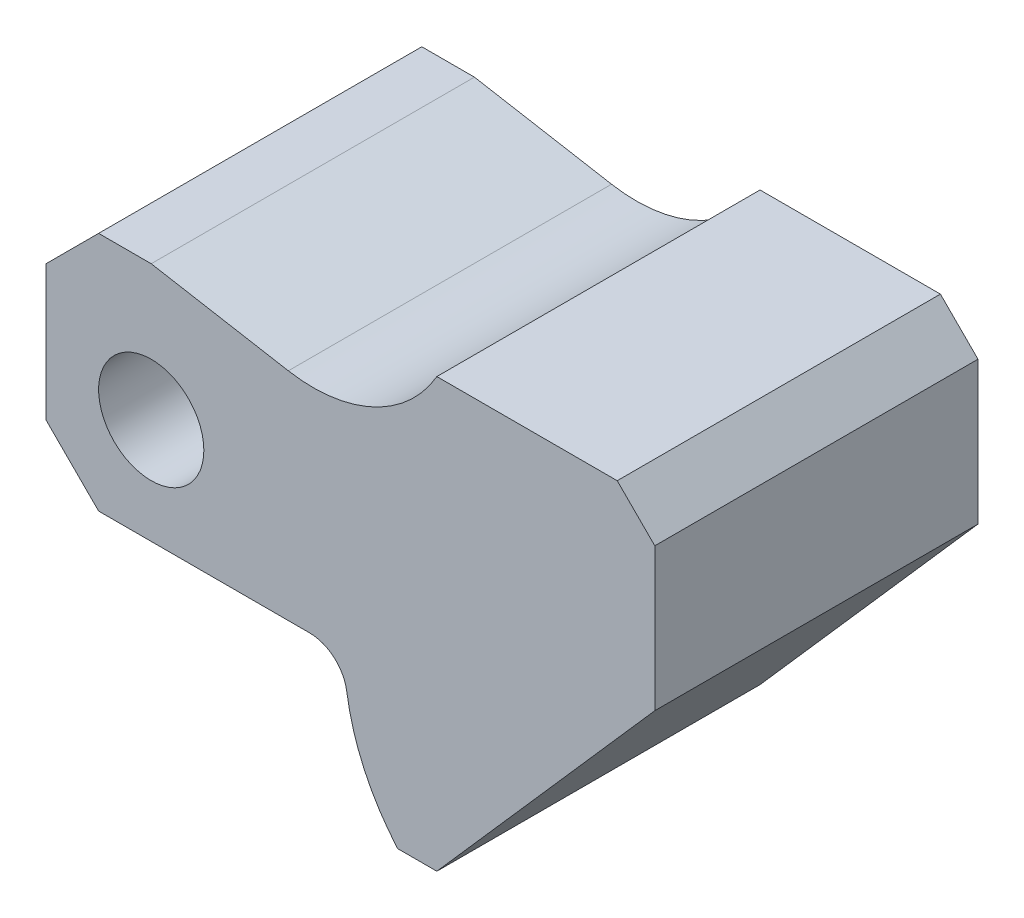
from build123d import *

# Parameters (mm, degrees)
SKETCH1_R           = 7
BOSS_EXTRUDE3_DEPTH = 43


with BuildPart() as part:
    # Sketch1 → Boss-Extrude3 (new body)
    with BuildSketch(Plane.XY):
        with BuildLine():
            Line((0, 26), (7, 19))
            Line((7, 19), (35.066626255, 19))
            ThreePointArc((35.066626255, 19), (38.331862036, 17.786586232), (40.012264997, 14.735294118))
            ThreePointArc((40.012264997, 14.735294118), (42.3490952, 6.884327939), (46.788067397, 0))
            Line((46.788067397, 0), (52, 0))
            Line((52, 0), (81, 33))
            Line((81, 33), (81, 52))
            Line((81, 52), (76, 57))
            Line((76, 57), (52, 57))
            ThreePointArc((52, 57), (43.574971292, 49.276045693), (32.243067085, 47.783220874))
            Line((32.243067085, 47.783220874), (14, 50.999965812))
            Line((14, 50.999965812), (7, 50.999965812))
            Line((7, 50.999965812), (0, 44))
            Line((0, 44), (0, 26))
        make_face()
        with Locations((14, 33)):
            Circle(SKETCH1_R, mode=Mode.SUBTRACT)
    extrude(amount=BOSS_EXTRUDE3_DEPTH)


solid = part.part
